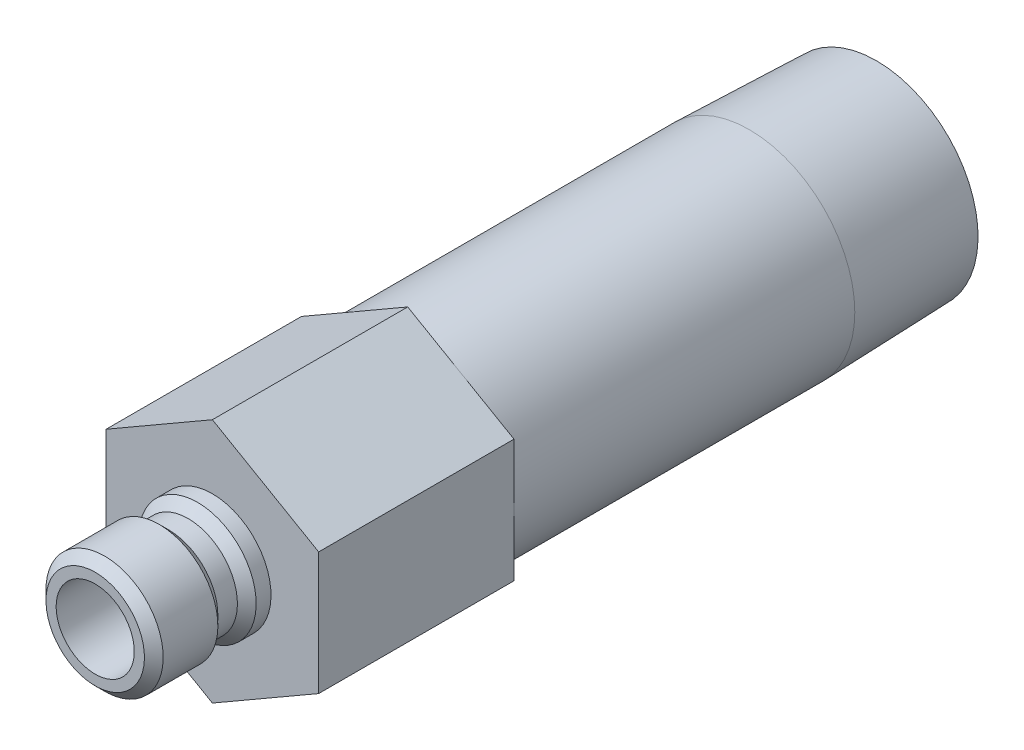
from build123d import *

# Parameters (mm, degrees)
SKETCH2_R           = 3.175
BOSS_EXTRUDE1_DEPTH = 15.875


with BuildPart() as part:
    # Sketch1 → Revolve1 (revolve)
    with BuildSketch(Plane(origin=(0, 0, 0), x_dir=(0, 0, -1), z_dir=(1, 0, 0))):
        Polygon((-9.525, 3.175), (-9.525, 4.0005), (-8.763, 4.7625), (-4.318, 4.7625), (-3.556, 4.0005), (-1.9685, 4.0005), (-1.2065, 4.7625), (0, 4.7625), (0, 8.5725), (43.6372, 8.5725), (53.975, 8.249445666), (53.975, 6.2611), (15.875, 6.2611), (15.875, 3.175), align=None)
    revolve(axis=Axis((0, 0, 0), (0, 0, 1)))

    # Sketch2 → Boss-Extrude1 (add)
    with BuildSketch(Plane.XY):
        Polygon((-8.636, 4.985996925), (-8.636, -4.985996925), (0, -9.971993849), (8.636, -4.985996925), (8.636, 4.985996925), (0, 9.971993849), align=None)
        with Locations(Location((0, 0, 0), (0, 0, 90))):
            Circle(SKETCH2_R, mode=Mode.SUBTRACT)
    extrude(amount=-BOSS_EXTRUDE1_DEPTH)


solid = part.part
